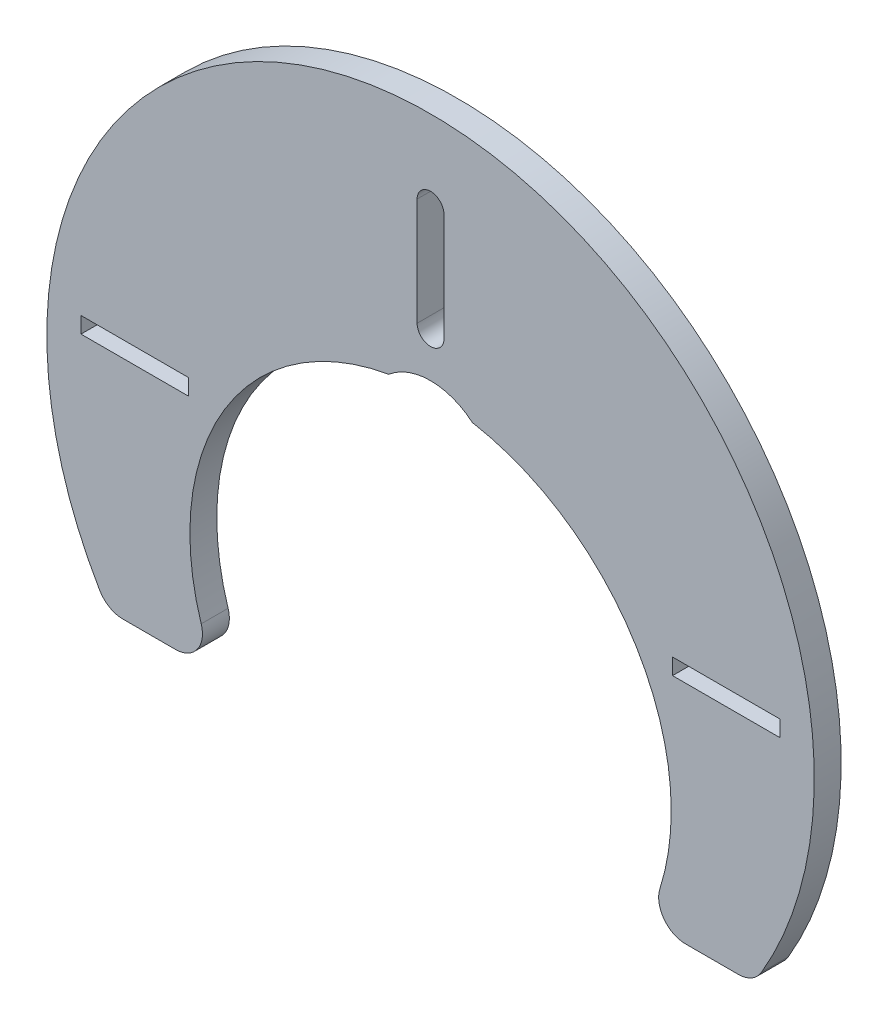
from build123d import *

# Parameters (mm, degrees)
EXTRUSION1_DEPTH        = 5
ESQUISSE2_R             = 12
ESQUISSE2_W             = 20
ESQUISSE2_H             = 3
ENL_V_MAT_EXTRU_1_DEPTH = 6
CONG_5_R                = 5


with BuildPart() as part:
    # Esquisse1 → Extrusion1 (new body)
    with BuildSketch(Plane.XY):
        with BuildLine():
            Line((-61.59972119, -30.488104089), (-41.59972119, -30.488104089))
            ThreePointArc((-41.59972119, -30.488104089), (-1.59972119, 34.340394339), (38.40027881, -30.488104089))
            Line((38.40027881, -30.488104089), (58.40027881, -30.488104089))
            ThreePointArc((58.40027881, -30.488104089), (-1.59972119, 79.488842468), (-61.59972119, -30.488104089))
        make_face()
    extrude(amount=EXTRUSION1_DEPTH)

    # Esquisse2 → Enl_v. mat.-Extru.1 (cut)
    with BuildSketch(Plane.XY.offset(5)):
        with Locations((-1.59972119, 24.511895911)):
            Circle(ESQUISSE2_R)
        with Locations((53.40027881, 13.011895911)):
            Rectangle(ESQUISSE2_W, ESQUISSE2_H)
        with Locations((-56.59972119, 13.011895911)):
            Rectangle(ESQUISSE2_W, ESQUISSE2_H)
        with BuildLine():
            Line((-4.09972119, 64.511895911), (-4.09972119, 44.511895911))
            ThreePointArc((-4.09972119, 44.511895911), (-1.59972119, 42.011895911), (0.90027881, 44.511895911))
            Line((0.90027881, 44.511895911), (0.90027881, 64.511895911))
            ThreePointArc((0.90027881, 64.511895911), (-1.59972119, 67.011895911), (-4.09972119, 64.511895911))
        make_face()
    extrude(amount=-ENL_V_MAT_EXTRU_1_DEPTH, mode=Mode.SUBTRACT)

    # Cong_5
    cong_5_edges = [part.edges().sort_by_distance(p)[0] for p in [
        (58.40027881, -30.488104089, 2.5),
        (38.40027881, -30.488104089, 2.5),
        (-41.59972119, -30.488104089, 2.5),
        (-61.59972119, -30.488104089, 2.5),
    ]]
    fillet(cong_5_edges, radius=CONG_5_R)


solid = part.part
